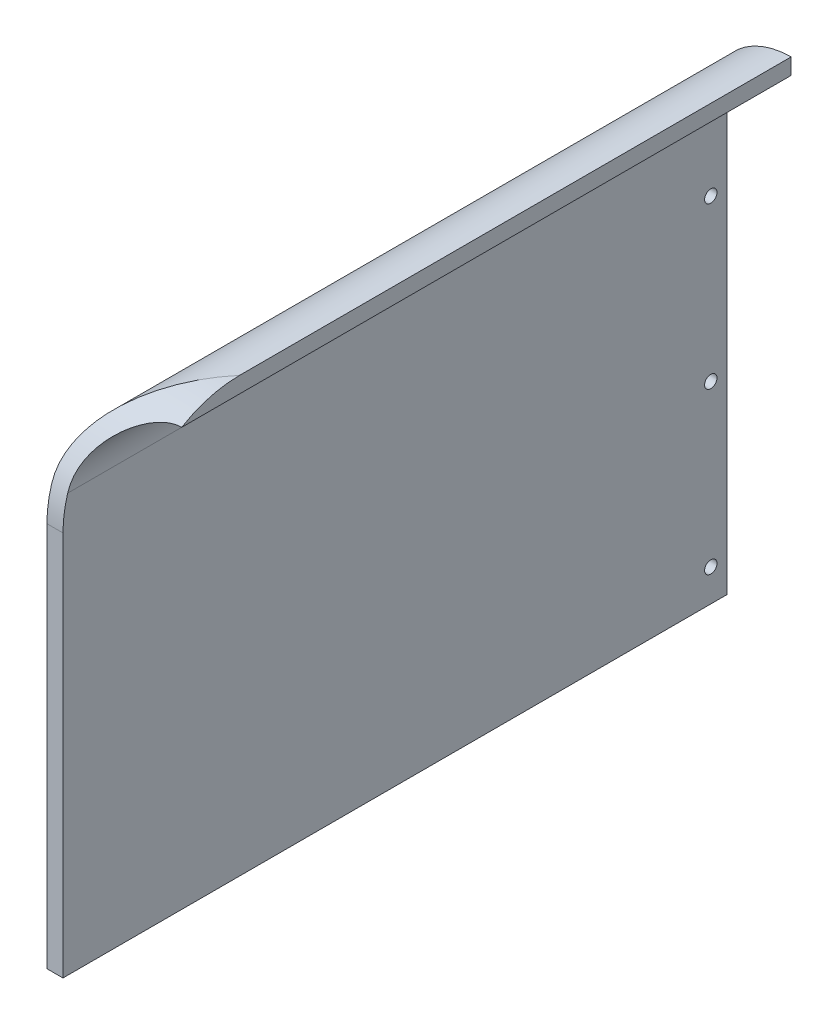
from build123d import *

# Parameters (mm, degrees)
SKETCH1_W      = 525.018
SKETCH1_H      = 304.8
EXTRUDE1_DEPTH = 12.7
SKETCH2_R      = 4.9022
EXTRUDE2_DEPTH = 608.213496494
EXTRUDE3_DEPTH = 525.018
EXTRUDE4_DEPTH = 660.299507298


with BuildPart() as part:
    # Sketch1 → Extrude1 (new body)
    with BuildSketch(Plane(origin=(0, 0, 0), x_dir=(0, 0, -1), z_dir=(1, 0, 0))):
        with Locations((262.509, 152.4)):
            Rectangle(SKETCH1_W, SKETCH1_H)
    extrude(amount=EXTRUDE1_DEPTH)

    # Sketch2 → Extrude2 (cut, through all)
    with BuildSketch(Plane.ZY):
        with Locations((-512.318, 25.4)):
            Circle(SKETCH2_R)
        with Locations((-512.318, 279.4)):
            Circle(SKETCH2_R)
        with Locations((-512.318, 152.4)):
            Circle(SKETCH2_R)
    extrude(amount=-EXTRUDE2_DEPTH, mode=Mode.SUBTRACT)

    # Sketch3 → Extrude3 (add)
    with BuildSketch(Plane(origin=(0, 0, -525.018), x_dir=(-1, 0, 0), z_dir=(0, 0, -1))):
        with BuildLine():
            Line((0, 304.8), (-12.7, 304.8))
            Line((-12.7, 304.8), (-12.7, 330.2))
            ThreePointArc((-12.7, 330.2), (-27.578975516, 366.121024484), (-63.5, 381))
            Line((-63.5, 381), (-63.5, 393.7))
            ThreePointArc((-63.5, 393.7), (-18.598719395, 375.101280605), (0, 330.2))
            Line((0, 330.2), (0, 304.8))
        make_face()
    extrude(amount=-EXTRUDE3_DEPTH)

    # Sketch4 → Extrude4 (cut, through all)
    with BuildSketch(Plane.ZY):
        with BuildLine():
            Line((0, 304.8), (0, 435.327217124))
            Line((0, 435.327217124), (-88.9, 435.327217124))
            Line((-88.9, 435.327217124), (-88.9, 393.7))
            ThreePointArc((-88.9, 393.7), (-26.038207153, 367.661792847), (0, 304.8))
        make_face()
    extrude(amount=-EXTRUDE4_DEPTH, mode=Mode.SUBTRACT)


solid = part.part
